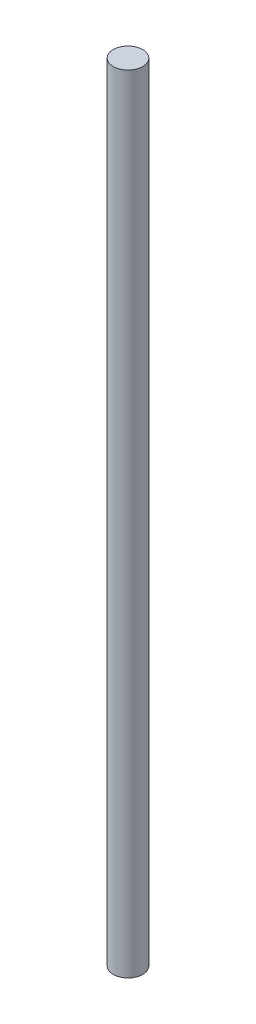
from build123d import *

# Parameters (mm, degrees)
SKETCH1_R      = 4.7625
EXTRUDE1_DEPTH = 127


with BuildPart() as part:
    # Sketch1 → Extrude1 (new, symmetric)
    with BuildSketch(Plane(origin=(0, 0, 0), x_dir=(1, 0, 0), z_dir=(0, 1, 0))):
        with Locations(Location((0, 0, 0), (0, 0, 270))):
            Circle(SKETCH1_R)
    extrude(amount=EXTRUDE1_DEPTH, both=True)


solid = part.part
